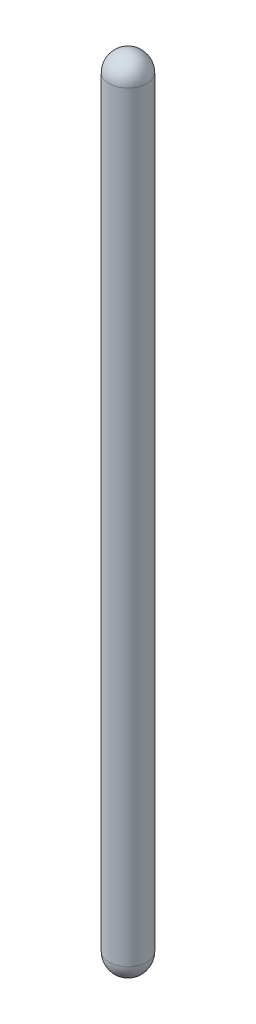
from build123d import *

# Parameters (mm, degrees)
SKETCH2_R           = 4.975
BOSS_EXTRUDE1_DEPTH = 200
DOME1_FACE_RADIUS   = 4.975
DOME1_HEIGHT        = 4.975
DOME2_FACE_RADIUS   = 4.975
DOME2_HEIGHT        = 4.975


with BuildPart() as part:
    # Sketch2 → Boss-Extrude1 (new body)
    with BuildSketch(Plane(origin=(0, 0, 0), x_dir=(1, 0, 0), z_dir=(0, 1, 0))):
        with Locations(Location((0, 0, 0), (0, 0, 270))):
            Circle(SKETCH2_R)
    extrude(amount=BOSS_EXTRUDE1_DEPTH)

    # Dome1: a dome of height H over a round flat face of radius A is a cap of a sphere of radius (A * A + H * H) / (2 * H)
    dome1_r = (DOME1_FACE_RADIUS * DOME1_FACE_RADIUS + DOME1_HEIGHT * DOME1_HEIGHT) / (2 * DOME1_HEIGHT)
    dome1_base = Plane((0, 200, 0), z_dir=(0, 1, 0))
    with Locations(dome1_base.offset(DOME1_HEIGHT - dome1_r)):
        dome1_ball = Sphere(dome1_r, mode=Mode.PRIVATE)
    add(split(dome1_ball, bisect_by=dome1_base, keep=Keep.TOP, mode=Mode.PRIVATE))

    # Dome2: a dome of height H over a round flat face of radius A is a cap of a sphere of radius (A * A + H * H) / (2 * H)
    dome2_r = (DOME2_FACE_RADIUS * DOME2_FACE_RADIUS + DOME2_HEIGHT * DOME2_HEIGHT) / (2 * DOME2_HEIGHT)
    dome2_base = Plane((0, 0, 0), z_dir=(0, -1, 0))
    with Locations(dome2_base.offset(DOME2_HEIGHT - dome2_r)):
        dome2_ball = Sphere(dome2_r, mode=Mode.PRIVATE)
    add(split(dome2_ball, bisect_by=dome2_base, keep=Keep.TOP, mode=Mode.PRIVATE))


solid = part.part
